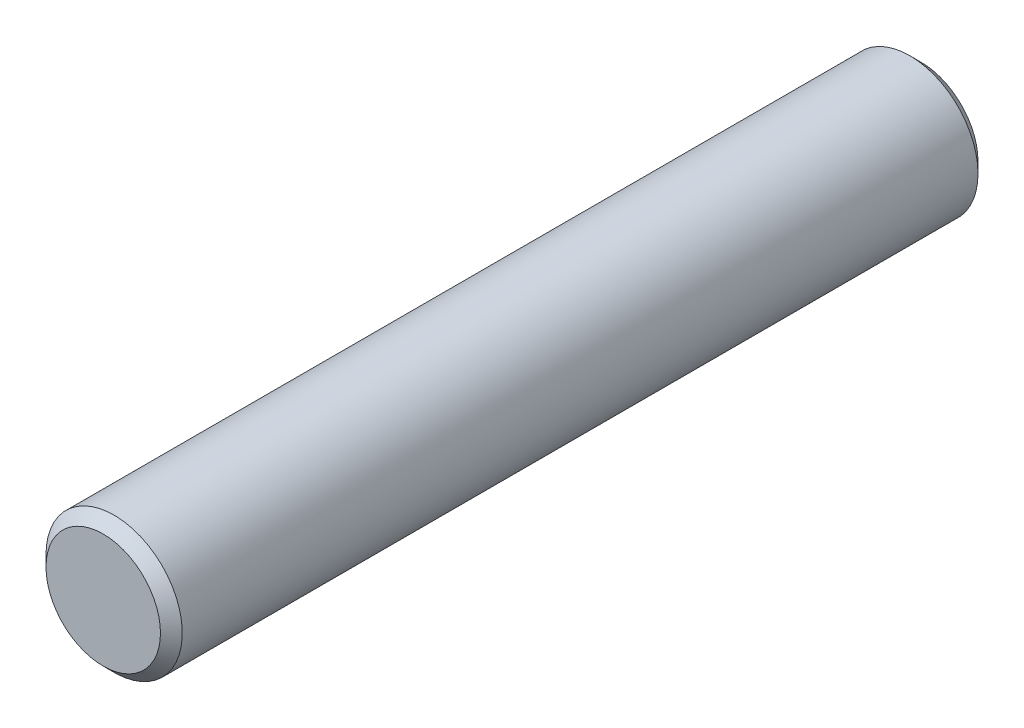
from build123d import *

# Parameters (mm, degrees)
SKETCH1_R      = 0.79375
EXTRUDE1_DEPTH = 9.525
CHAMFER1_SIZE  = 0.127


with BuildPart() as part:
    # Sketch1 → Extrude1 (new body)
    with BuildSketch(Plane.XY):
        with Locations(Location((0, 0, 0), (0, 0, 180))):
            Circle(SKETCH1_R)
    extrude(amount=EXTRUDE1_DEPTH)

    # Chamfer1
    chamfer1_edges = [part.edges().sort_by_distance(p)[0] for p in [
        (0.79375, 0, 0),
        (0.79375, 0, 9.525),
    ]]
    chamfer(chamfer1_edges, length=CHAMFER1_SIZE)


solid = part.part
